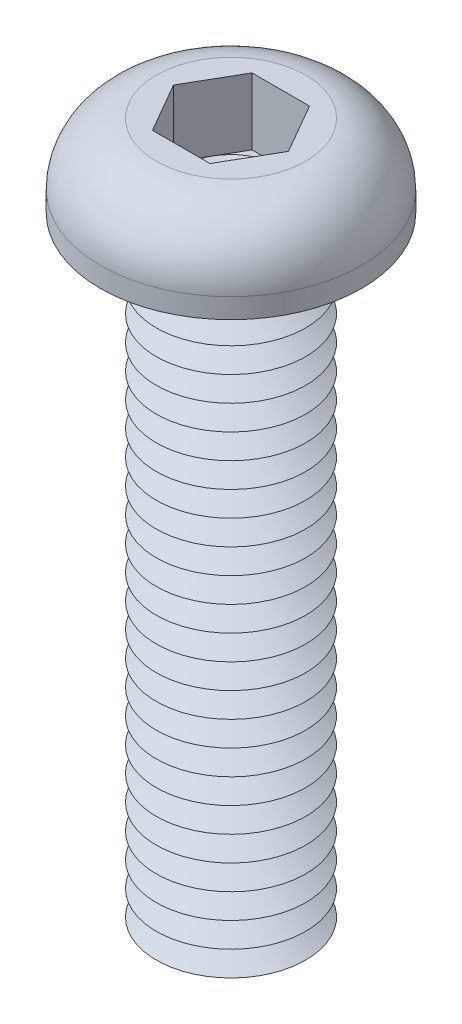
ISO-10303-21;
HEADER;
FILE_DESCRIPTION(('STEP AP214'),'2;1');
FILE_NAME('part.step','',(''),(''),'','','');
FILE_SCHEMA(('AUTOMOTIVE_DESIGN { 1 0 10303 214 1 1 1 1 }'));
ENDSEC;
DATA;
#1=APPLICATION_CONTEXT('core data for automotive mechanical design processes');
#2=APPLICATION_PROTOCOL_DEFINITION('international standard','automotive_design',2000,#1);
#3=PRODUCT_CONTEXT('',#1,'mechanical');
#4=PRODUCT('Part','Part','',(#3));
#5=PRODUCT_RELATED_PRODUCT_CATEGORY('part','',(#4));
#6=PRODUCT_DEFINITION_FORMATION('','',#4);
#7=PRODUCT_DEFINITION_CONTEXT('part definition',#1,'design');
#8=PRODUCT_DEFINITION('design','',#6,#7);
#9=PRODUCT_DEFINITION_SHAPE('','',#8);
#10=(LENGTH_UNIT() NAMED_UNIT(*) SI_UNIT(.MILLI.,.METRE.));
#11=(NAMED_UNIT(*) PLANE_ANGLE_UNIT() SI_UNIT($,.RADIAN.));
#12=(NAMED_UNIT(*) SI_UNIT($,.STERADIAN.) SOLID_ANGLE_UNIT());
#13=UNCERTAINTY_MEASURE_WITH_UNIT(LENGTH_MEASURE(1.E-05),#10,'distance_accuracy_value','');
#14=(GEOMETRIC_REPRESENTATION_CONTEXT(3) GLOBAL_UNCERTAINTY_ASSIGNED_CONTEXT((#13)) GLOBAL_UNIT_ASSIGNED_CONTEXT((#10,
#11,#12)) REPRESENTATION_CONTEXT('',''));
#15=CARTESIAN_POINT('',(0.,0.,0.));
#16=DIRECTION('',(0.,0.,1.));
#17=DIRECTION('',(1.,0.,0.));
#18=AXIS2_PLACEMENT_3D('',#15,#16,#17);
#19=CARTESIAN_POINT('',(0.,0.,0.));
#20=DIRECTION('',(0.,-1.,0.));
#21=DIRECTION('',(0.,0.,-1.));
#22=AXIS2_PLACEMENT_3D('',#19,#20,#21);
#23=TOROIDAL_SURFACE('',#22,3.5,0.5);
#24=CARTESIAN_POINT('',(0.,0.,-4.));
#25=VERTEX_POINT('',#24);
#26=VERTEX_LOOP('',#25);
#27=FACE_BOUND('',#26,.T.);
#28=ADVANCED_FACE('P0_F12',(#27),#23,.T.);
#29=CLOSED_SHELL('',(#28));
#30=MANIFOLD_SOLID_BREP('P0_B1',#29);
#31=CARTESIAN_POINT('',(1.15470053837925,0.62,-2.));
#32=DIRECTION('',(0.,1.,0.));
#33=DIRECTION('',(0.,0.,1.));
#34=AXIS2_PLACEMENT_3D('',#31,#32,#33);
#35=PLANE('',#34);
#36=CARTESIAN_POINT('',(0.,0.62,0.));
#37=DIRECTION('',(0.,1.,0.));
#38=DIRECTION('',(0.,0.,1.));
#39=AXIS2_PLACEMENT_3D('',#36,#37,#38);
#40=CIRCLE('',#39,2.);
#41=CARTESIAN_POINT('',(0.,0.62,2.));
#42=VERTEX_POINT('',#41);
#43=CARTESIAN_POINT('',(1.73205080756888,0.62,1.));
#44=VERTEX_POINT('',#43);
#45=EDGE_CURVE('P1_E93',#42,#44,#40,.T.);
#46=ORIENTED_EDGE('',*,*,#45,.F.);
#47=DIRECTION('',(1.,0.,0.));
#48=VECTOR('',#47,1.);
#49=CARTESIAN_POINT('',(-1.15470053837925,0.62,2.));
#50=LINE('',#49,#48);
#51=CARTESIAN_POINT('',(1.15470053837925,0.62,2.));
#52=VERTEX_POINT('',#51);
#53=EDGE_CURVE('P1_E116',#42,#52,#50,.T.);
#54=ORIENTED_EDGE('',*,*,#53,.T.);
#55=DIRECTION('',(0.5,0.,-0.866025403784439));
#56=VECTOR('',#55,1.);
#57=CARTESIAN_POINT('',(1.15470053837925,0.62,2.));
#58=LINE('',#57,#56);
#59=EDGE_CURVE('P1_E112',#52,#44,#58,.T.);
#60=ORIENTED_EDGE('',*,*,#59,.T.);
#61=EDGE_LOOP('',(#46,#54,#60));
#62=FACE_BOUND('',#61,.T.);
#63=ADVANCED_FACE('P1_F15',(#62),#35,.T.);
#64=CARTESIAN_POINT('',(0.,0.62,0.));
#65=DIRECTION('',(0.,1.,0.));
#66=DIRECTION('',(0.,0.,1.));
#67=AXIS2_PLACEMENT_3D('',#64,#65,#66);
#68=CIRCLE('',#67,2.);
#69=CARTESIAN_POINT('',(1.73205080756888,0.62,-1.));
#70=VERTEX_POINT('',#69);
#71=EDGE_CURVE('P1_E10',#44,#70,#68,.T.);
#72=ORIENTED_EDGE('',*,*,#71,.F.);
#73=CARTESIAN_POINT('',(2.3094010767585,0.62,0.));
#74=VERTEX_POINT('',#73);
#75=EDGE_CURVE('P1_E104',#44,#74,#58,.T.);
#76=ORIENTED_EDGE('',*,*,#75,.T.);
#77=DIRECTION('',(-0.5,0.,-0.866025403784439));
#78=VECTOR('',#77,1.);
#79=CARTESIAN_POINT('',(2.3094010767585,0.62,0.));
#80=LINE('',#79,#78);
#81=EDGE_CURVE('P1_E107',#74,#70,#80,.T.);
#82=ORIENTED_EDGE('',*,*,#81,.T.);
#83=EDGE_LOOP('',(#72,#76,#82));
#84=FACE_BOUND('',#83,.T.);
#85=ADVANCED_FACE('P1_F103',(#84),#35,.T.);
#86=CARTESIAN_POINT('',(0.,0.62,-2.));
#87=VERTEX_POINT('',#86);
#88=EDGE_CURVE('P1_E24',#70,#87,#68,.T.);
#89=ORIENTED_EDGE('',*,*,#88,.F.);
#90=CARTESIAN_POINT('',(1.15470053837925,0.62,-2.));
#91=VERTEX_POINT('',#90);
#92=EDGE_CURVE('P1_E139',#70,#91,#80,.T.);
#93=ORIENTED_EDGE('',*,*,#92,.T.);
#94=DIRECTION('',(-1.,0.,0.));
#95=VECTOR('',#94,1.);
#96=CARTESIAN_POINT('',(1.15470053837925,0.62,-2.));
#97=LINE('',#96,#95);
#98=EDGE_CURVE('P1_E366',#91,#87,#97,.T.);
#99=ORIENTED_EDGE('',*,*,#98,.T.);
#100=EDGE_LOOP('',(#89,#93,#99));
#101=FACE_BOUND('',#100,.T.);
#102=ADVANCED_FACE('P1_F331',(#101),#35,.T.);
#103=CARTESIAN_POINT('',(-1.73205080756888,0.62,-1.));
#104=VERTEX_POINT('',#103);
#105=EDGE_CURVE('P1_E361',#87,#104,#68,.T.);
#106=ORIENTED_EDGE('',*,*,#105,.F.);
#107=CARTESIAN_POINT('',(-1.15470053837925,0.62,-2.));
#108=VERTEX_POINT('',#107);
#109=EDGE_CURVE('P1_E370',#87,#108,#97,.T.);
#110=ORIENTED_EDGE('',*,*,#109,.T.);
#111=DIRECTION('',(-0.5,0.,0.866025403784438));
#112=VECTOR('',#111,1.);
#113=CARTESIAN_POINT('',(-1.15470053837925,0.62,-2.));
#114=LINE('',#113,#112);
#115=EDGE_CURVE('P1_E365',#108,#104,#114,.T.);
#116=ORIENTED_EDGE('',*,*,#115,.T.);
#117=EDGE_LOOP('',(#106,#110,#116));
#118=FACE_BOUND('',#117,.T.);
#119=ADVANCED_FACE('P1_F345',(#118),#35,.T.);
#120=CARTESIAN_POINT('',(-1.73205080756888,0.62,1.));
#121=VERTEX_POINT('',#120);
#122=EDGE_CURVE('P1_E31',#104,#121,#68,.T.);
#123=ORIENTED_EDGE('',*,*,#122,.F.);
#124=CARTESIAN_POINT('',(-2.3094010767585,0.62,0.));
#125=VERTEX_POINT('',#124);
#126=EDGE_CURVE('P1_E357',#104,#125,#114,.T.);
#127=ORIENTED_EDGE('',*,*,#126,.T.);
#128=DIRECTION('',(0.5,0.,0.866025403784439));
#129=VECTOR('',#128,1.);
#130=CARTESIAN_POINT('',(-2.3094010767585,0.62,0.));
#131=LINE('',#130,#129);
#132=EDGE_CURVE('P1_E360',#125,#121,#131,.T.);
#133=ORIENTED_EDGE('',*,*,#132,.T.);
#134=EDGE_LOOP('',(#123,#127,#133));
#135=FACE_BOUND('',#134,.T.);
#136=ADVANCED_FACE('P1_F336',(#135),#35,.T.);
#137=CARTESIAN_POINT('',(0.,-24.,0.));
#138=DIRECTION('',(0.,1.,0.));
#139=DIRECTION('',(0.,0.,1.));
#140=AXIS2_PLACEMENT_3D('',#137,#138,#139);
#141=CONICAL_SURFACE('',#140,2.13397459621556,1.0471975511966);
#142=CARTESIAN_POINT('',(0.,-23.5,0.));
#143=DIRECTION('',(0.,-1.,0.));
#144=DIRECTION('',(0.,0.,-1.));
#145=AXIS2_PLACEMENT_3D('',#142,#143,#144);
#146=CIRCLE('',#145,3.);
#147=CARTESIAN_POINT('',(0.,-23.5,-3.));
#148=VERTEX_POINT('',#147);
#149=EDGE_CURVE('P1_E293',#148,#148,#146,.T.);
#150=ORIENTED_EDGE('',*,*,#149,.T.);
#151=EDGE_LOOP('',(#150));
#152=FACE_BOUND('',#151,.T.);
#153=CARTESIAN_POINT('',(0.,-24.,0.));
#154=DIRECTION('',(0.,-1.,0.));
#155=DIRECTION('',(0.,0.,-1.));
#156=AXIS2_PLACEMENT_3D('',#153,#154,#155);
#157=CIRCLE('',#156,2.13397459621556);
#158=CARTESIAN_POINT('',(0.,-24.,-2.13397459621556));
#159=VERTEX_POINT('',#158);
#160=EDGE_CURVE('P1_E296',#159,#159,#157,.T.);
#161=ORIENTED_EDGE('',*,*,#160,.F.);
#162=EDGE_LOOP('',(#161));
#163=FACE_BOUND('',#162,.T.);
#164=ADVANCED_FACE('P1_F344',(#152,#163),#141,.T.);
#165=CARTESIAN_POINT('',(0.,-24.5,0.));
#166=DIRECTION('',(0.,-1.,0.));
#167=DIRECTION('',(0.,0.,-1.));
#168=AXIS2_PLACEMENT_3D('',#165,#166,#167);
#169=CONICAL_SURFACE('',#168,3.,1.0471975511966);
#170=ORIENTED_EDGE('',*,*,#160,.T.);
#171=EDGE_LOOP('',(#170));
#172=FACE_BOUND('',#171,.T.);
#173=CARTESIAN_POINT('',(0.,-24.5,0.));
#174=DIRECTION('',(0.,-1.,0.));
#175=DIRECTION('',(0.,0.,-1.));
#176=AXIS2_PLACEMENT_3D('',#173,#174,#175);
#177=CIRCLE('',#176,3.);
#178=CARTESIAN_POINT('',(0.,-24.5,-3.));
#179=VERTEX_POINT('',#178);
#180=EDGE_CURVE('P1_E299',#179,#179,#177,.T.);
#181=ORIENTED_EDGE('',*,*,#180,.F.);
#182=EDGE_LOOP('',(#181));
#183=FACE_BOUND('',#182,.T.);
#184=ADVANCED_FACE('P1_F351',(#172,#183),#169,.T.);
#185=CARTESIAN_POINT('',(0.,-25.,0.));
#186=DIRECTION('',(0.,1.,0.));
#187=DIRECTION('',(0.,0.,1.));
#188=AXIS2_PLACEMENT_3D('',#185,#186,#187);
#189=PLANE('',#188);
#190=CARTESIAN_POINT('',(0.,-25.,0.));
#191=DIRECTION('',(0.,-1.,0.));
#192=DIRECTION('',(0.,0.,-1.));
#193=AXIS2_PLACEMENT_3D('',#190,#191,#192);
#194=CIRCLE('',#193,2.13397459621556);
#195=CARTESIAN_POINT('',(0.,-25.,-2.13397459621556));
#196=VERTEX_POINT('',#195);
#197=EDGE_CURVE('P1_E302',#196,#196,#194,.T.);
#198=ORIENTED_EDGE('',*,*,#197,.T.);
#199=EDGE_LOOP('',(#198));
#200=FACE_BOUND('',#199,.T.);
#201=ADVANCED_FACE('P1_F429',(#200),#189,.F.);
#202=CARTESIAN_POINT('',(0.,-25.,0.));
#203=DIRECTION('',(0.,1.,0.));
#204=DIRECTION('',(0.,0.,1.));
#205=AXIS2_PLACEMENT_3D('',#202,#203,#204);
#206=CONICAL_SURFACE('',#205,2.13397459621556,1.0471975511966);
#207=ORIENTED_EDGE('',*,*,#180,.T.);
#208=EDGE_LOOP('',(#207));
#209=FACE_BOUND('',#208,.T.);
#210=ORIENTED_EDGE('',*,*,#197,.F.);
#211=EDGE_LOOP('',(#210));
#212=FACE_BOUND('',#211,.T.);
#213=ADVANCED_FACE('P1_F440',(#209,#212),#206,.T.);
#214=CARTESIAN_POINT('',(0.,-23.,0.));
#215=DIRECTION('',(0.,1.,0.));
#216=DIRECTION('',(0.,0.,1.));
#217=AXIS2_PLACEMENT_3D('',#214,#215,#216);
#218=CONICAL_SURFACE('',#217,2.13397459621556,1.0471975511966);
#219=CARTESIAN_POINT('',(0.,-22.5,0.));
#220=DIRECTION('',(0.,-1.,0.));
#221=DIRECTION('',(0.,0.,-1.));
#222=AXIS2_PLACEMENT_3D('',#219,#220,#221);
#223=CIRCLE('',#222,3.);
#224=CARTESIAN_POINT('',(0.,-22.5,-3.));
#225=VERTEX_POINT('',#224);
#226=EDGE_CURVE('P1_E287',#225,#225,#223,.T.);
#227=ORIENTED_EDGE('',*,*,#226,.T.);
#228=EDGE_LOOP('',(#227));
#229=FACE_BOUND('',#228,.T.);
#230=CARTESIAN_POINT('',(0.,-23.,0.));
#231=DIRECTION('',(0.,-1.,0.));
#232=DIRECTION('',(0.,0.,-1.));
#233=AXIS2_PLACEMENT_3D('',#230,#231,#232);
#234=CIRCLE('',#233,2.13397459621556);
#235=CARTESIAN_POINT('',(0.,-23.,-2.13397459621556));
#236=VERTEX_POINT('',#235);
#237=EDGE_CURVE('P1_E290',#236,#236,#234,.T.);
#238=ORIENTED_EDGE('',*,*,#237,.F.);
#239=EDGE_LOOP('',(#238));
#240=FACE_BOUND('',#239,.T.);
#241=ADVANCED_FACE('P1_F449',(#229,#240),#218,.T.);
#242=CARTESIAN_POINT('',(0.,-23.5,0.));
#243=DIRECTION('',(0.,-1.,0.));
#244=DIRECTION('',(0.,0.,-1.));
#245=AXIS2_PLACEMENT_3D('',#242,#243,#244);
#246=CONICAL_SURFACE('',#245,3.,1.0471975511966);
#247=ORIENTED_EDGE('',*,*,#237,.T.);
#248=EDGE_LOOP('',(#247));
#249=FACE_BOUND('',#248,.T.);
#250=ORIENTED_EDGE('',*,*,#149,.F.);
#251=EDGE_LOOP('',(#250));
#252=FACE_BOUND('',#251,.T.);
#253=ADVANCED_FACE('P1_F458',(#249,#252),#246,.T.);
#254=CARTESIAN_POINT('',(0.,-22.,0.));
#255=DIRECTION('',(0.,1.,0.));
#256=DIRECTION('',(0.,0.,1.));
#257=AXIS2_PLACEMENT_3D('',#254,#255,#256);
#258=CONICAL_SURFACE('',#257,2.13397459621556,1.0471975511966);
#259=CARTESIAN_POINT('',(0.,-21.5,0.));
#260=DIRECTION('',(0.,-1.,0.));
#261=DIRECTION('',(0.,0.,-1.));
#262=AXIS2_PLACEMENT_3D('',#259,#260,#261);
#263=CIRCLE('',#262,3.);
#264=CARTESIAN_POINT('',(0.,-21.5,-3.));
#265=VERTEX_POINT('',#264);
#266=EDGE_CURVE('P1_E281',#265,#265,#263,.T.);
#267=ORIENTED_EDGE('',*,*,#266,.T.);
#268=EDGE_LOOP('',(#267));
#269=FACE_BOUND('',#268,.T.);
#270=CARTESIAN_POINT('',(0.,-22.,0.));
#271=DIRECTION('',(0.,-1.,0.));
#272=DIRECTION('',(0.,0.,-1.));
#273=AXIS2_PLACEMENT_3D('',#270,#271,#272);
#274=CIRCLE('',#273,2.13397459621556);
#275=CARTESIAN_POINT('',(0.,-22.,-2.13397459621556));
#276=VERTEX_POINT('',#275);
#277=EDGE_CURVE('P1_E284',#276,#276,#274,.T.);
#278=ORIENTED_EDGE('',*,*,#277,.F.);
#279=EDGE_LOOP('',(#278));
#280=FACE_BOUND('',#279,.T.);
#281=ADVANCED_FACE('P1_F468',(#269,#280),#258,.T.);
#282=CARTESIAN_POINT('',(0.,-22.5,0.));
#283=DIRECTION('',(0.,-1.,0.));
#284=DIRECTION('',(0.,0.,-1.));
#285=AXIS2_PLACEMENT_3D('',#282,#283,#284);
#286=CONICAL_SURFACE('',#285,3.,1.0471975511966);
#287=ORIENTED_EDGE('',*,*,#277,.T.);
#288=EDGE_LOOP('',(#287));
#289=FACE_BOUND('',#288,.T.);
#290=ORIENTED_EDGE('',*,*,#226,.F.);
#291=EDGE_LOOP('',(#290));
#292=FACE_BOUND('',#291,.T.);
#293=ADVANCED_FACE('P1_F478',(#289,#292),#286,.T.);
#294=CARTESIAN_POINT('',(0.,-21.,0.));
#295=DIRECTION('',(0.,1.,0.));
#296=DIRECTION('',(0.,0.,1.));
#297=AXIS2_PLACEMENT_3D('',#294,#295,#296);
#298=CONICAL_SURFACE('',#297,2.13397459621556,1.0471975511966);
#299=CARTESIAN_POINT('',(0.,-20.5,0.));
#300=DIRECTION('',(0.,-1.,0.));
#301=DIRECTION('',(0.,0.,-1.));
#302=AXIS2_PLACEMENT_3D('',#299,#300,#301);
#303=CIRCLE('',#302,3.);
#304=CARTESIAN_POINT('',(0.,-20.5,-3.));
#305=VERTEX_POINT('',#304);
#306=EDGE_CURVE('P1_E275',#305,#305,#303,.T.);
#307=ORIENTED_EDGE('',*,*,#306,.T.);
#308=EDGE_LOOP('',(#307));
#309=FACE_BOUND('',#308,.T.);
#310=CARTESIAN_POINT('',(0.,-21.,0.));
#311=DIRECTION('',(0.,-1.,0.));
#312=DIRECTION('',(0.,0.,-1.));
#313=AXIS2_PLACEMENT_3D('',#310,#311,#312);
#314=CIRCLE('',#313,2.13397459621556);
#315=CARTESIAN_POINT('',(0.,-21.,-2.13397459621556));
#316=VERTEX_POINT('',#315);
#317=EDGE_CURVE('P1_E278',#316,#316,#314,.T.);
#318=ORIENTED_EDGE('',*,*,#317,.F.);
#319=EDGE_LOOP('',(#318));
#320=FACE_BOUND('',#319,.T.);
#321=ADVANCED_FACE('P1_F488',(#309,#320),#298,.T.);
#322=CARTESIAN_POINT('',(0.,-21.5,0.));
#323=DIRECTION('',(0.,-1.,0.));
#324=DIRECTION('',(0.,0.,-1.));
#325=AXIS2_PLACEMENT_3D('',#322,#323,#324);
#326=CONICAL_SURFACE('',#325,3.,1.0471975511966);
#327=ORIENTED_EDGE('',*,*,#317,.T.);
#328=EDGE_LOOP('',(#327));
#329=FACE_BOUND('',#328,.T.);
#330=ORIENTED_EDGE('',*,*,#266,.F.);
#331=EDGE_LOOP('',(#330));
#332=FACE_BOUND('',#331,.T.);
#333=ADVANCED_FACE('P1_F498',(#329,#332),#326,.T.);
#334=CARTESIAN_POINT('',(0.,-20.,0.));
#335=DIRECTION('',(0.,1.,0.));
#336=DIRECTION('',(0.,0.,1.));
#337=AXIS2_PLACEMENT_3D('',#334,#335,#336);
#338=CONICAL_SURFACE('',#337,2.13397459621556,1.0471975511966);
#339=CARTESIAN_POINT('',(0.,-19.5,0.));
#340=DIRECTION('',(0.,-1.,0.));
#341=DIRECTION('',(0.,0.,-1.));
#342=AXIS2_PLACEMENT_3D('',#339,#340,#341);
#343=CIRCLE('',#342,3.);
#344=CARTESIAN_POINT('',(0.,-19.5,-3.));
#345=VERTEX_POINT('',#344);
#346=EDGE_CURVE('P1_E269',#345,#345,#343,.T.);
#347=ORIENTED_EDGE('',*,*,#346,.T.);
#348=EDGE_LOOP('',(#347));
#349=FACE_BOUND('',#348,.T.);
#350=CARTESIAN_POINT('',(0.,-20.,0.));
#351=DIRECTION('',(0.,-1.,0.));
#352=DIRECTION('',(0.,0.,-1.));
#353=AXIS2_PLACEMENT_3D('',#350,#351,#352);
#354=CIRCLE('',#353,2.13397459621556);
#355=CARTESIAN_POINT('',(0.,-20.,-2.13397459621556));
#356=VERTEX_POINT('',#355);
#357=EDGE_CURVE('P1_E272',#356,#356,#354,.T.);
#358=ORIENTED_EDGE('',*,*,#357,.F.);
#359=EDGE_LOOP('',(#358));
#360=FACE_BOUND('',#359,.T.);
#361=ADVANCED_FACE('P1_F508',(#349,#360),#338,.T.);
#362=CARTESIAN_POINT('',(0.,-20.5,0.));
#363=DIRECTION('',(0.,-1.,0.));
#364=DIRECTION('',(0.,0.,-1.));
#365=AXIS2_PLACEMENT_3D('',#362,#363,#364);
#366=CONICAL_SURFACE('',#365,3.,1.0471975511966);
#367=ORIENTED_EDGE('',*,*,#357,.T.);
#368=EDGE_LOOP('',(#367));
#369=FACE_BOUND('',#368,.T.);
#370=ORIENTED_EDGE('',*,*,#306,.F.);
#371=EDGE_LOOP('',(#370));
#372=FACE_BOUND('',#371,.T.);
#373=ADVANCED_FACE('P1_F518',(#369,#372),#366,.T.);
#374=CARTESIAN_POINT('',(0.,-19.,0.));
#375=DIRECTION('',(0.,1.,0.));
#376=DIRECTION('',(0.,0.,1.));
#377=AXIS2_PLACEMENT_3D('',#374,#375,#376);
#378=CONICAL_SURFACE('',#377,2.13397459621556,1.0471975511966);
#379=CARTESIAN_POINT('',(0.,-18.5,0.));
#380=DIRECTION('',(0.,-1.,0.));
#381=DIRECTION('',(0.,0.,-1.));
#382=AXIS2_PLACEMENT_3D('',#379,#380,#381);
#383=CIRCLE('',#382,3.);
#384=CARTESIAN_POINT('',(0.,-18.5,-3.));
#385=VERTEX_POINT('',#384);
#386=EDGE_CURVE('P1_E263',#385,#385,#383,.T.);
#387=ORIENTED_EDGE('',*,*,#386,.T.);
#388=EDGE_LOOP('',(#387));
#389=FACE_BOUND('',#388,.T.);
#390=CARTESIAN_POINT('',(0.,-19.,0.));
#391=DIRECTION('',(0.,-1.,0.));
#392=DIRECTION('',(0.,0.,-1.));
#393=AXIS2_PLACEMENT_3D('',#390,#391,#392);
#394=CIRCLE('',#393,2.13397459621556);
#395=CARTESIAN_POINT('',(0.,-19.,-2.13397459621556));
#396=VERTEX_POINT('',#395);
#397=EDGE_CURVE('P1_E266',#396,#396,#394,.T.);
#398=ORIENTED_EDGE('',*,*,#397,.F.);
#399=EDGE_LOOP('',(#398));
#400=FACE_BOUND('',#399,.T.);
#401=ADVANCED_FACE('P1_F528',(#389,#400),#378,.T.);
#402=CARTESIAN_POINT('',(0.,-19.5,0.));
#403=DIRECTION('',(0.,-1.,0.));
#404=DIRECTION('',(0.,0.,-1.));
#405=AXIS2_PLACEMENT_3D('',#402,#403,#404);
#406=CONICAL_SURFACE('',#405,3.,1.0471975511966);
#407=ORIENTED_EDGE('',*,*,#397,.T.);
#408=EDGE_LOOP('',(#407));
#409=FACE_BOUND('',#408,.T.);
#410=ORIENTED_EDGE('',*,*,#346,.F.);
#411=EDGE_LOOP('',(#410));
#412=FACE_BOUND('',#411,.T.);
#413=ADVANCED_FACE('P1_F538',(#409,#412),#406,.T.);
#414=CARTESIAN_POINT('',(0.,-18.,0.));
#415=DIRECTION('',(0.,1.,0.));
#416=DIRECTION('',(0.,0.,1.));
#417=AXIS2_PLACEMENT_3D('',#414,#415,#416);
#418=CONICAL_SURFACE('',#417,2.13397459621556,1.0471975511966);
#419=CARTESIAN_POINT('',(0.,-17.5,0.));
#420=DIRECTION('',(0.,-1.,0.));
#421=DIRECTION('',(0.,0.,-1.));
#422=AXIS2_PLACEMENT_3D('',#419,#420,#421);
#423=CIRCLE('',#422,3.);
#424=CARTESIAN_POINT('',(0.,-17.5,-3.));
#425=VERTEX_POINT('',#424);
#426=EDGE_CURVE('P1_E257',#425,#425,#423,.T.);
#427=ORIENTED_EDGE('',*,*,#426,.T.);
#428=EDGE_LOOP('',(#427));
#429=FACE_BOUND('',#428,.T.);
#430=CARTESIAN_POINT('',(0.,-18.,0.));
#431=DIRECTION('',(0.,-1.,0.));
#432=DIRECTION('',(0.,0.,-1.));
#433=AXIS2_PLACEMENT_3D('',#430,#431,#432);
#434=CIRCLE('',#433,2.13397459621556);
#435=CARTESIAN_POINT('',(0.,-18.,-2.13397459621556));
#436=VERTEX_POINT('',#435);
#437=EDGE_CURVE('P1_E260',#436,#436,#434,.T.);
#438=ORIENTED_EDGE('',*,*,#437,.F.);
#439=EDGE_LOOP('',(#438));
#440=FACE_BOUND('',#439,.T.);
#441=ADVANCED_FACE('P1_F548',(#429,#440),#418,.T.);
#442=CARTESIAN_POINT('',(0.,-18.5,0.));
#443=DIRECTION('',(0.,-1.,0.));
#444=DIRECTION('',(0.,0.,-1.));
#445=AXIS2_PLACEMENT_3D('',#442,#443,#444);
#446=CONICAL_SURFACE('',#445,3.,1.0471975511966);
#447=ORIENTED_EDGE('',*,*,#437,.T.);
#448=EDGE_LOOP('',(#447));
#449=FACE_BOUND('',#448,.T.);
#450=ORIENTED_EDGE('',*,*,#386,.F.);
#451=EDGE_LOOP('',(#450));
#452=FACE_BOUND('',#451,.T.);
#453=ADVANCED_FACE('P1_F558',(#449,#452),#446,.T.);
#454=CARTESIAN_POINT('',(0.,-17.,0.));
#455=DIRECTION('',(0.,1.,0.));
#456=DIRECTION('',(0.,0.,1.));
#457=AXIS2_PLACEMENT_3D('',#454,#455,#456);
#458=CONICAL_SURFACE('',#457,2.13397459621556,1.0471975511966);
#459=CARTESIAN_POINT('',(0.,-16.5,0.));
#460=DIRECTION('',(0.,-1.,0.));
#461=DIRECTION('',(0.,0.,-1.));
#462=AXIS2_PLACEMENT_3D('',#459,#460,#461);
#463=CIRCLE('',#462,3.);
#464=CARTESIAN_POINT('',(0.,-16.5,-3.));
#465=VERTEX_POINT('',#464);
#466=EDGE_CURVE('P1_E251',#465,#465,#463,.T.);
#467=ORIENTED_EDGE('',*,*,#466,.T.);
#468=EDGE_LOOP('',(#467));
#469=FACE_BOUND('',#468,.T.);
#470=CARTESIAN_POINT('',(0.,-17.,0.));
#471=DIRECTION('',(0.,-1.,0.));
#472=DIRECTION('',(0.,0.,-1.));
#473=AXIS2_PLACEMENT_3D('',#470,#471,#472);
#474=CIRCLE('',#473,2.13397459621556);
#475=CARTESIAN_POINT('',(0.,-17.,-2.13397459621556));
#476=VERTEX_POINT('',#475);
#477=EDGE_CURVE('P1_E254',#476,#476,#474,.T.);
#478=ORIENTED_EDGE('',*,*,#477,.F.);
#479=EDGE_LOOP('',(#478));
#480=FACE_BOUND('',#479,.T.);
#481=ADVANCED_FACE('P1_F568',(#469,#480),#458,.T.);
#482=CARTESIAN_POINT('',(0.,-17.5,0.));
#483=DIRECTION('',(0.,-1.,0.));
#484=DIRECTION('',(0.,0.,-1.));
#485=AXIS2_PLACEMENT_3D('',#482,#483,#484);
#486=CONICAL_SURFACE('',#485,3.,1.0471975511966);
#487=ORIENTED_EDGE('',*,*,#477,.T.);
#488=EDGE_LOOP('',(#487));
#489=FACE_BOUND('',#488,.T.);
#490=ORIENTED_EDGE('',*,*,#426,.F.);
#491=EDGE_LOOP('',(#490));
#492=FACE_BOUND('',#491,.T.);
#493=ADVANCED_FACE('P1_F578',(#489,#492),#486,.T.);
#494=CARTESIAN_POINT('',(0.,-16.,0.));
#495=DIRECTION('',(0.,1.,0.));
#496=DIRECTION('',(0.,0.,1.));
#497=AXIS2_PLACEMENT_3D('',#494,#495,#496);
#498=CONICAL_SURFACE('',#497,2.13397459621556,1.0471975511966);
#499=CARTESIAN_POINT('',(0.,-15.5,0.));
#500=DIRECTION('',(0.,-1.,0.));
#501=DIRECTION('',(0.,0.,-1.));
#502=AXIS2_PLACEMENT_3D('',#499,#500,#501);
#503=CIRCLE('',#502,3.);
#504=CARTESIAN_POINT('',(0.,-15.5,-3.));
#505=VERTEX_POINT('',#504);
#506=EDGE_CURVE('P1_E245',#505,#505,#503,.T.);
#507=ORIENTED_EDGE('',*,*,#506,.T.);
#508=EDGE_LOOP('',(#507));
#509=FACE_BOUND('',#508,.T.);
#510=CARTESIAN_POINT('',(0.,-16.,0.));
#511=DIRECTION('',(0.,-1.,0.));
#512=DIRECTION('',(0.,0.,-1.));
#513=AXIS2_PLACEMENT_3D('',#510,#511,#512);
#514=CIRCLE('',#513,2.13397459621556);
#515=CARTESIAN_POINT('',(0.,-16.,-2.13397459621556));
#516=VERTEX_POINT('',#515);
#517=EDGE_CURVE('P1_E248',#516,#516,#514,.T.);
#518=ORIENTED_EDGE('',*,*,#517,.F.);
#519=EDGE_LOOP('',(#518));
#520=FACE_BOUND('',#519,.T.);
#521=ADVANCED_FACE('P1_F588',(#509,#520),#498,.T.);
#522=CARTESIAN_POINT('',(0.,-16.5,0.));
#523=DIRECTION('',(0.,-1.,0.));
#524=DIRECTION('',(0.,0.,-1.));
#525=AXIS2_PLACEMENT_3D('',#522,#523,#524);
#526=CONICAL_SURFACE('',#525,3.,1.0471975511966);
#527=ORIENTED_EDGE('',*,*,#517,.T.);
#528=EDGE_LOOP('',(#527));
#529=FACE_BOUND('',#528,.T.);
#530=ORIENTED_EDGE('',*,*,#466,.F.);
#531=EDGE_LOOP('',(#530));
#532=FACE_BOUND('',#531,.T.);
#533=ADVANCED_FACE('P1_F598',(#529,#532),#526,.T.);
#534=CARTESIAN_POINT('',(0.,-15.,0.));
#535=DIRECTION('',(0.,1.,0.));
#536=DIRECTION('',(0.,0.,1.));
#537=AXIS2_PLACEMENT_3D('',#534,#535,#536);
#538=CONICAL_SURFACE('',#537,2.13397459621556,1.0471975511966);
#539=CARTESIAN_POINT('',(0.,-14.5,0.));
#540=DIRECTION('',(0.,-1.,0.));
#541=DIRECTION('',(0.,0.,-1.));
#542=AXIS2_PLACEMENT_3D('',#539,#540,#541);
#543=CIRCLE('',#542,3.);
#544=CARTESIAN_POINT('',(0.,-14.5,-3.));
#545=VERTEX_POINT('',#544);
#546=EDGE_CURVE('P1_E239',#545,#545,#543,.T.);
#547=ORIENTED_EDGE('',*,*,#546,.T.);
#548=EDGE_LOOP('',(#547));
#549=FACE_BOUND('',#548,.T.);
#550=CARTESIAN_POINT('',(0.,-15.,0.));
#551=DIRECTION('',(0.,-1.,0.));
#552=DIRECTION('',(0.,0.,-1.));
#553=AXIS2_PLACEMENT_3D('',#550,#551,#552);
#554=CIRCLE('',#553,2.13397459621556);
#555=CARTESIAN_POINT('',(0.,-15.,-2.13397459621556));
#556=VERTEX_POINT('',#555);
#557=EDGE_CURVE('P1_E242',#556,#556,#554,.T.);
#558=ORIENTED_EDGE('',*,*,#557,.F.);
#559=EDGE_LOOP('',(#558));
#560=FACE_BOUND('',#559,.T.);
#561=ADVANCED_FACE('P1_F608',(#549,#560),#538,.T.);
#562=CARTESIAN_POINT('',(0.,-15.5,0.));
#563=DIRECTION('',(0.,-1.,0.));
#564=DIRECTION('',(0.,0.,-1.));
#565=AXIS2_PLACEMENT_3D('',#562,#563,#564);
#566=CONICAL_SURFACE('',#565,3.,1.0471975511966);
#567=ORIENTED_EDGE('',*,*,#557,.T.);
#568=EDGE_LOOP('',(#567));
#569=FACE_BOUND('',#568,.T.);
#570=ORIENTED_EDGE('',*,*,#506,.F.);
#571=EDGE_LOOP('',(#570));
#572=FACE_BOUND('',#571,.T.);
#573=ADVANCED_FACE('P1_F618',(#569,#572),#566,.T.);
#574=CARTESIAN_POINT('',(0.,-14.,0.));
#575=DIRECTION('',(0.,1.,0.));
#576=DIRECTION('',(0.,0.,1.));
#577=AXIS2_PLACEMENT_3D('',#574,#575,#576);
#578=CONICAL_SURFACE('',#577,2.13397459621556,1.0471975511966);
#579=CARTESIAN_POINT('',(0.,-13.5,0.));
#580=DIRECTION('',(0.,-1.,0.));
#581=DIRECTION('',(0.,0.,-1.));
#582=AXIS2_PLACEMENT_3D('',#579,#580,#581);
#583=CIRCLE('',#582,3.);
#584=CARTESIAN_POINT('',(0.,-13.5,-3.));
#585=VERTEX_POINT('',#584);
#586=EDGE_CURVE('P1_E233',#585,#585,#583,.T.);
#587=ORIENTED_EDGE('',*,*,#586,.T.);
#588=EDGE_LOOP('',(#587));
#589=FACE_BOUND('',#588,.T.);
#590=CARTESIAN_POINT('',(0.,-14.,0.));
#591=DIRECTION('',(0.,-1.,0.));
#592=DIRECTION('',(0.,0.,-1.));
#593=AXIS2_PLACEMENT_3D('',#590,#591,#592);
#594=CIRCLE('',#593,2.13397459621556);
#595=CARTESIAN_POINT('',(0.,-14.,-2.13397459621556));
#596=VERTEX_POINT('',#595);
#597=EDGE_CURVE('P1_E236',#596,#596,#594,.T.);
#598=ORIENTED_EDGE('',*,*,#597,.F.);
#599=EDGE_LOOP('',(#598));
#600=FACE_BOUND('',#599,.T.);
#601=ADVANCED_FACE('P1_F628',(#589,#600),#578,.T.);
#602=CARTESIAN_POINT('',(0.,-14.5,0.));
#603=DIRECTION('',(0.,-1.,0.));
#604=DIRECTION('',(0.,0.,-1.));
#605=AXIS2_PLACEMENT_3D('',#602,#603,#604);
#606=CONICAL_SURFACE('',#605,3.,1.0471975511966);
#607=ORIENTED_EDGE('',*,*,#597,.T.);
#608=EDGE_LOOP('',(#607));
#609=FACE_BOUND('',#608,.T.);
#610=ORIENTED_EDGE('',*,*,#546,.F.);
#611=EDGE_LOOP('',(#610));
#612=FACE_BOUND('',#611,.T.);
#613=ADVANCED_FACE('P1_F638',(#609,#612),#606,.T.);
#614=CARTESIAN_POINT('',(0.,-13.,0.));
#615=DIRECTION('',(0.,1.,0.));
#616=DIRECTION('',(0.,0.,1.));
#617=AXIS2_PLACEMENT_3D('',#614,#615,#616);
#618=CONICAL_SURFACE('',#617,2.13397459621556,1.0471975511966);
#619=CARTESIAN_POINT('',(0.,-12.5,0.));
#620=DIRECTION('',(0.,-1.,0.));
#621=DIRECTION('',(0.,0.,-1.));
#622=AXIS2_PLACEMENT_3D('',#619,#620,#621);
#623=CIRCLE('',#622,3.);
#624=CARTESIAN_POINT('',(0.,-12.5,-3.));
#625=VERTEX_POINT('',#624);
#626=EDGE_CURVE('P1_E227',#625,#625,#623,.T.);
#627=ORIENTED_EDGE('',*,*,#626,.T.);
#628=EDGE_LOOP('',(#627));
#629=FACE_BOUND('',#628,.T.);
#630=CARTESIAN_POINT('',(0.,-13.,0.));
#631=DIRECTION('',(0.,-1.,0.));
#632=DIRECTION('',(0.,0.,-1.));
#633=AXIS2_PLACEMENT_3D('',#630,#631,#632);
#634=CIRCLE('',#633,2.13397459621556);
#635=CARTESIAN_POINT('',(0.,-13.,-2.13397459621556));
#636=VERTEX_POINT('',#635);
#637=EDGE_CURVE('P1_E230',#636,#636,#634,.T.);
#638=ORIENTED_EDGE('',*,*,#637,.F.);
#639=EDGE_LOOP('',(#638));
#640=FACE_BOUND('',#639,.T.);
#641=ADVANCED_FACE('P1_F648',(#629,#640),#618,.T.);
#642=CARTESIAN_POINT('',(0.,-13.5,0.));
#643=DIRECTION('',(0.,-1.,0.));
#644=DIRECTION('',(0.,0.,-1.));
#645=AXIS2_PLACEMENT_3D('',#642,#643,#644);
#646=CONICAL_SURFACE('',#645,3.,1.0471975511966);
#647=ORIENTED_EDGE('',*,*,#637,.T.);
#648=EDGE_LOOP('',(#647));
#649=FACE_BOUND('',#648,.T.);
#650=ORIENTED_EDGE('',*,*,#586,.F.);
#651=EDGE_LOOP('',(#650));
#652=FACE_BOUND('',#651,.T.);
#653=ADVANCED_FACE('P1_F658',(#649,#652),#646,.T.);
#654=CARTESIAN_POINT('',(0.,-12.,0.));
#655=DIRECTION('',(0.,1.,0.));
#656=DIRECTION('',(0.,0.,1.));
#657=AXIS2_PLACEMENT_3D('',#654,#655,#656);
#658=CONICAL_SURFACE('',#657,2.13397459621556,1.0471975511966);
#659=CARTESIAN_POINT('',(0.,-11.5,0.));
#660=DIRECTION('',(0.,-1.,0.));
#661=DIRECTION('',(0.,0.,-1.));
#662=AXIS2_PLACEMENT_3D('',#659,#660,#661);
#663=CIRCLE('',#662,3.);
#664=CARTESIAN_POINT('',(0.,-11.5,-3.));
#665=VERTEX_POINT('',#664);
#666=EDGE_CURVE('P1_E221',#665,#665,#663,.T.);
#667=ORIENTED_EDGE('',*,*,#666,.T.);
#668=EDGE_LOOP('',(#667));
#669=FACE_BOUND('',#668,.T.);
#670=CARTESIAN_POINT('',(0.,-12.,0.));
#671=DIRECTION('',(0.,-1.,0.));
#672=DIRECTION('',(0.,0.,-1.));
#673=AXIS2_PLACEMENT_3D('',#670,#671,#672);
#674=CIRCLE('',#673,2.13397459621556);
#675=CARTESIAN_POINT('',(0.,-12.,-2.13397459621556));
#676=VERTEX_POINT('',#675);
#677=EDGE_CURVE('P1_E224',#676,#676,#674,.T.);
#678=ORIENTED_EDGE('',*,*,#677,.F.);
#679=EDGE_LOOP('',(#678));
#680=FACE_BOUND('',#679,.T.);
#681=ADVANCED_FACE('P1_F668',(#669,#680),#658,.T.);
#682=CARTESIAN_POINT('',(0.,-12.5,0.));
#683=DIRECTION('',(0.,-1.,0.));
#684=DIRECTION('',(0.,0.,-1.));
#685=AXIS2_PLACEMENT_3D('',#682,#683,#684);
#686=CONICAL_SURFACE('',#685,3.,1.0471975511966);
#687=ORIENTED_EDGE('',*,*,#677,.T.);
#688=EDGE_LOOP('',(#687));
#689=FACE_BOUND('',#688,.T.);
#690=ORIENTED_EDGE('',*,*,#626,.F.);
#691=EDGE_LOOP('',(#690));
#692=FACE_BOUND('',#691,.T.);
#693=ADVANCED_FACE('P1_F678',(#689,#692),#686,.T.);
#694=CARTESIAN_POINT('',(0.,-11.,0.));
#695=DIRECTION('',(0.,1.,0.));
#696=DIRECTION('',(0.,0.,1.));
#697=AXIS2_PLACEMENT_3D('',#694,#695,#696);
#698=CONICAL_SURFACE('',#697,2.13397459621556,1.0471975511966);
#699=CARTESIAN_POINT('',(0.,-10.5,0.));
#700=DIRECTION('',(0.,-1.,0.));
#701=DIRECTION('',(0.,0.,-1.));
#702=AXIS2_PLACEMENT_3D('',#699,#700,#701);
#703=CIRCLE('',#702,3.);
#704=CARTESIAN_POINT('',(0.,-10.5,-3.));
#705=VERTEX_POINT('',#704);
#706=EDGE_CURVE('P1_E215',#705,#705,#703,.T.);
#707=ORIENTED_EDGE('',*,*,#706,.T.);
#708=EDGE_LOOP('',(#707));
#709=FACE_BOUND('',#708,.T.);
#710=CARTESIAN_POINT('',(0.,-11.,0.));
#711=DIRECTION('',(0.,-1.,0.));
#712=DIRECTION('',(0.,0.,-1.));
#713=AXIS2_PLACEMENT_3D('',#710,#711,#712);
#714=CIRCLE('',#713,2.13397459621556);
#715=CARTESIAN_POINT('',(0.,-11.,-2.13397459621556));
#716=VERTEX_POINT('',#715);
#717=EDGE_CURVE('P1_E218',#716,#716,#714,.T.);
#718=ORIENTED_EDGE('',*,*,#717,.F.);
#719=EDGE_LOOP('',(#718));
#720=FACE_BOUND('',#719,.T.);
#721=ADVANCED_FACE('P1_F688',(#709,#720),#698,.T.);
#722=CARTESIAN_POINT('',(0.,-11.5,0.));
#723=DIRECTION('',(0.,-1.,0.));
#724=DIRECTION('',(0.,0.,-1.));
#725=AXIS2_PLACEMENT_3D('',#722,#723,#724);
#726=CONICAL_SURFACE('',#725,3.,1.0471975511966);
#727=ORIENTED_EDGE('',*,*,#717,.T.);
#728=EDGE_LOOP('',(#727));
#729=FACE_BOUND('',#728,.T.);
#730=ORIENTED_EDGE('',*,*,#666,.F.);
#731=EDGE_LOOP('',(#730));
#732=FACE_BOUND('',#731,.T.);
#733=ADVANCED_FACE('P1_F698',(#729,#732),#726,.T.);
#734=CARTESIAN_POINT('',(0.,-10.,0.));
#735=DIRECTION('',(0.,1.,0.));
#736=DIRECTION('',(0.,0.,1.));
#737=AXIS2_PLACEMENT_3D('',#734,#735,#736);
#738=CONICAL_SURFACE('',#737,2.13397459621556,1.0471975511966);
#739=CARTESIAN_POINT('',(0.,-9.5,0.));
#740=DIRECTION('',(0.,-1.,0.));
#741=DIRECTION('',(0.,0.,-1.));
#742=AXIS2_PLACEMENT_3D('',#739,#740,#741);
#743=CIRCLE('',#742,3.);
#744=CARTESIAN_POINT('',(0.,-9.5,-3.));
#745=VERTEX_POINT('',#744);
#746=EDGE_CURVE('P1_E209',#745,#745,#743,.T.);
#747=ORIENTED_EDGE('',*,*,#746,.T.);
#748=EDGE_LOOP('',(#747));
#749=FACE_BOUND('',#748,.T.);
#750=CARTESIAN_POINT('',(0.,-10.,0.));
#751=DIRECTION('',(0.,-1.,0.));
#752=DIRECTION('',(0.,0.,-1.));
#753=AXIS2_PLACEMENT_3D('',#750,#751,#752);
#754=CIRCLE('',#753,2.13397459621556);
#755=CARTESIAN_POINT('',(0.,-10.,-2.13397459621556));
#756=VERTEX_POINT('',#755);
#757=EDGE_CURVE('P1_E212',#756,#756,#754,.T.);
#758=ORIENTED_EDGE('',*,*,#757,.F.);
#759=EDGE_LOOP('',(#758));
#760=FACE_BOUND('',#759,.T.);
#761=ADVANCED_FACE('P1_F708',(#749,#760),#738,.T.);
#762=CARTESIAN_POINT('',(0.,-10.5,0.));
#763=DIRECTION('',(0.,-1.,0.));
#764=DIRECTION('',(0.,0.,-1.));
#765=AXIS2_PLACEMENT_3D('',#762,#763,#764);
#766=CONICAL_SURFACE('',#765,3.,1.0471975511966);
#767=ORIENTED_EDGE('',*,*,#757,.T.);
#768=EDGE_LOOP('',(#767));
#769=FACE_BOUND('',#768,.T.);
#770=ORIENTED_EDGE('',*,*,#706,.F.);
#771=EDGE_LOOP('',(#770));
#772=FACE_BOUND('',#771,.T.);
#773=ADVANCED_FACE('P1_F718',(#769,#772),#766,.T.);
#774=CARTESIAN_POINT('',(0.,-9.,0.));
#775=DIRECTION('',(0.,1.,0.));
#776=DIRECTION('',(0.,0.,1.));
#777=AXIS2_PLACEMENT_3D('',#774,#775,#776);
#778=CONICAL_SURFACE('',#777,2.13397459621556,1.0471975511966);
#779=CARTESIAN_POINT('',(0.,-8.5,0.));
#780=DIRECTION('',(0.,-1.,0.));
#781=DIRECTION('',(0.,0.,-1.));
#782=AXIS2_PLACEMENT_3D('',#779,#780,#781);
#783=CIRCLE('',#782,3.);
#784=CARTESIAN_POINT('',(0.,-8.5,-3.));
#785=VERTEX_POINT('',#784);
#786=EDGE_CURVE('P1_E203',#785,#785,#783,.T.);
#787=ORIENTED_EDGE('',*,*,#786,.T.);
#788=EDGE_LOOP('',(#787));
#789=FACE_BOUND('',#788,.T.);
#790=CARTESIAN_POINT('',(0.,-9.,0.));
#791=DIRECTION('',(0.,-1.,0.));
#792=DIRECTION('',(0.,0.,-1.));
#793=AXIS2_PLACEMENT_3D('',#790,#791,#792);
#794=CIRCLE('',#793,2.13397459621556);
#795=CARTESIAN_POINT('',(0.,-9.,-2.13397459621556));
#796=VERTEX_POINT('',#795);
#797=EDGE_CURVE('P1_E206',#796,#796,#794,.T.);
#798=ORIENTED_EDGE('',*,*,#797,.F.);
#799=EDGE_LOOP('',(#798));
#800=FACE_BOUND('',#799,.T.);
#801=ADVANCED_FACE('P1_F728',(#789,#800),#778,.T.);
#802=CARTESIAN_POINT('',(0.,-9.5,0.));
#803=DIRECTION('',(0.,-1.,0.));
#804=DIRECTION('',(0.,0.,-1.));
#805=AXIS2_PLACEMENT_3D('',#802,#803,#804);
#806=CONICAL_SURFACE('',#805,3.,1.0471975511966);
#807=ORIENTED_EDGE('',*,*,#797,.T.);
#808=EDGE_LOOP('',(#807));
#809=FACE_BOUND('',#808,.T.);
#810=ORIENTED_EDGE('',*,*,#746,.F.);
#811=EDGE_LOOP('',(#810));
#812=FACE_BOUND('',#811,.T.);
#813=ADVANCED_FACE('P1_F738',(#809,#812),#806,.T.);
#814=CARTESIAN_POINT('',(0.,-8.,0.));
#815=DIRECTION('',(0.,1.,0.));
#816=DIRECTION('',(0.,0.,1.));
#817=AXIS2_PLACEMENT_3D('',#814,#815,#816);
#818=CONICAL_SURFACE('',#817,2.13397459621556,1.0471975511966);
#819=CARTESIAN_POINT('',(0.,-7.5,0.));
#820=DIRECTION('',(0.,-1.,0.));
#821=DIRECTION('',(0.,0.,-1.));
#822=AXIS2_PLACEMENT_3D('',#819,#820,#821);
#823=CIRCLE('',#822,3.);
#824=CARTESIAN_POINT('',(0.,-7.5,-3.));
#825=VERTEX_POINT('',#824);
#826=EDGE_CURVE('P1_E197',#825,#825,#823,.T.);
#827=ORIENTED_EDGE('',*,*,#826,.T.);
#828=EDGE_LOOP('',(#827));
#829=FACE_BOUND('',#828,.T.);
#830=CARTESIAN_POINT('',(0.,-8.,0.));
#831=DIRECTION('',(0.,-1.,0.));
#832=DIRECTION('',(0.,0.,-1.));
#833=AXIS2_PLACEMENT_3D('',#830,#831,#832);
#834=CIRCLE('',#833,2.13397459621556);
#835=CARTESIAN_POINT('',(0.,-8.,-2.13397459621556));
#836=VERTEX_POINT('',#835);
#837=EDGE_CURVE('P1_E200',#836,#836,#834,.T.);
#838=ORIENTED_EDGE('',*,*,#837,.F.);
#839=EDGE_LOOP('',(#838));
#840=FACE_BOUND('',#839,.T.);
#841=ADVANCED_FACE('P1_F748',(#829,#840),#818,.T.);
#842=CARTESIAN_POINT('',(0.,-8.5,0.));
#843=DIRECTION('',(0.,-1.,0.));
#844=DIRECTION('',(0.,0.,-1.));
#845=AXIS2_PLACEMENT_3D('',#842,#843,#844);
#846=CONICAL_SURFACE('',#845,3.,1.0471975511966);
#847=ORIENTED_EDGE('',*,*,#837,.T.);
#848=EDGE_LOOP('',(#847));
#849=FACE_BOUND('',#848,.T.);
#850=ORIENTED_EDGE('',*,*,#786,.F.);
#851=EDGE_LOOP('',(#850));
#852=FACE_BOUND('',#851,.T.);
#853=ADVANCED_FACE('P1_F758',(#849,#852),#846,.T.);
#854=CARTESIAN_POINT('',(0.,-7.,0.));
#855=DIRECTION('',(0.,1.,0.));
#856=DIRECTION('',(0.,0.,1.));
#857=AXIS2_PLACEMENT_3D('',#854,#855,#856);
#858=CONICAL_SURFACE('',#857,2.13397459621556,1.0471975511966);
#859=CARTESIAN_POINT('',(0.,-6.5,0.));
#860=DIRECTION('',(0.,-1.,0.));
#861=DIRECTION('',(0.,0.,-1.));
#862=AXIS2_PLACEMENT_3D('',#859,#860,#861);
#863=CIRCLE('',#862,3.);
#864=CARTESIAN_POINT('',(0.,-6.5,-3.));
#865=VERTEX_POINT('',#864);
#866=EDGE_CURVE('P1_E191',#865,#865,#863,.T.);
#867=ORIENTED_EDGE('',*,*,#866,.T.);
#868=EDGE_LOOP('',(#867));
#869=FACE_BOUND('',#868,.T.);
#870=CARTESIAN_POINT('',(0.,-7.,0.));
#871=DIRECTION('',(0.,-1.,0.));
#872=DIRECTION('',(0.,0.,-1.));
#873=AXIS2_PLACEMENT_3D('',#870,#871,#872);
#874=CIRCLE('',#873,2.13397459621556);
#875=CARTESIAN_POINT('',(0.,-7.,-2.13397459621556));
#876=VERTEX_POINT('',#875);
#877=EDGE_CURVE('P1_E194',#876,#876,#874,.T.);
#878=ORIENTED_EDGE('',*,*,#877,.F.);
#879=EDGE_LOOP('',(#878));
#880=FACE_BOUND('',#879,.T.);
#881=ADVANCED_FACE('P1_F768',(#869,#880),#858,.T.);
#882=CARTESIAN_POINT('',(0.,-7.5,0.));
#883=DIRECTION('',(0.,-1.,0.));
#884=DIRECTION('',(0.,0.,-1.));
#885=AXIS2_PLACEMENT_3D('',#882,#883,#884);
#886=CONICAL_SURFACE('',#885,3.,1.0471975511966);
#887=ORIENTED_EDGE('',*,*,#877,.T.);
#888=EDGE_LOOP('',(#887));
#889=FACE_BOUND('',#888,.T.);
#890=ORIENTED_EDGE('',*,*,#826,.F.);
#891=EDGE_LOOP('',(#890));
#892=FACE_BOUND('',#891,.T.);
#893=ADVANCED_FACE('P1_F778',(#889,#892),#886,.T.);
#894=CARTESIAN_POINT('',(0.,-6.,0.));
#895=DIRECTION('',(0.,1.,0.));
#896=DIRECTION('',(0.,0.,1.));
#897=AXIS2_PLACEMENT_3D('',#894,#895,#896);
#898=CONICAL_SURFACE('',#897,2.13397459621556,1.0471975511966);
#899=CARTESIAN_POINT('',(0.,-5.5,0.));
#900=DIRECTION('',(0.,-1.,0.));
#901=DIRECTION('',(0.,0.,-1.));
#902=AXIS2_PLACEMENT_3D('',#899,#900,#901);
#903=CIRCLE('',#902,3.);
#904=CARTESIAN_POINT('',(0.,-5.5,-3.));
#905=VERTEX_POINT('',#904);
#906=EDGE_CURVE('P1_E185',#905,#905,#903,.T.);
#907=ORIENTED_EDGE('',*,*,#906,.T.);
#908=EDGE_LOOP('',(#907));
#909=FACE_BOUND('',#908,.T.);
#910=CARTESIAN_POINT('',(0.,-6.,0.));
#911=DIRECTION('',(0.,-1.,0.));
#912=DIRECTION('',(0.,0.,-1.));
#913=AXIS2_PLACEMENT_3D('',#910,#911,#912);
#914=CIRCLE('',#913,2.13397459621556);
#915=CARTESIAN_POINT('',(0.,-6.,-2.13397459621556));
#916=VERTEX_POINT('',#915);
#917=EDGE_CURVE('P1_E188',#916,#916,#914,.T.);
#918=ORIENTED_EDGE('',*,*,#917,.F.);
#919=EDGE_LOOP('',(#918));
#920=FACE_BOUND('',#919,.T.);
#921=ADVANCED_FACE('P1_F788',(#909,#920),#898,.T.);
#922=CARTESIAN_POINT('',(0.,-6.5,0.));
#923=DIRECTION('',(0.,-1.,0.));
#924=DIRECTION('',(0.,0.,-1.));
#925=AXIS2_PLACEMENT_3D('',#922,#923,#924);
#926=CONICAL_SURFACE('',#925,3.,1.0471975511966);
#927=ORIENTED_EDGE('',*,*,#917,.T.);
#928=EDGE_LOOP('',(#927));
#929=FACE_BOUND('',#928,.T.);
#930=ORIENTED_EDGE('',*,*,#866,.F.);
#931=EDGE_LOOP('',(#930));
#932=FACE_BOUND('',#931,.T.);
#933=ADVANCED_FACE('P1_F798',(#929,#932),#926,.T.);
#934=CARTESIAN_POINT('',(0.,-5.,0.));
#935=DIRECTION('',(0.,1.,0.));
#936=DIRECTION('',(0.,0.,1.));
#937=AXIS2_PLACEMENT_3D('',#934,#935,#936);
#938=CONICAL_SURFACE('',#937,2.13397459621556,1.0471975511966);
#939=CARTESIAN_POINT('',(0.,-4.5,0.));
#940=DIRECTION('',(0.,-1.,0.));
#941=DIRECTION('',(0.,0.,-1.));
#942=AXIS2_PLACEMENT_3D('',#939,#940,#941);
#943=CIRCLE('',#942,3.);
#944=CARTESIAN_POINT('',(0.,-4.5,-3.));
#945=VERTEX_POINT('',#944);
#946=EDGE_CURVE('P1_E179',#945,#945,#943,.T.);
#947=ORIENTED_EDGE('',*,*,#946,.T.);
#948=EDGE_LOOP('',(#947));
#949=FACE_BOUND('',#948,.T.);
#950=CARTESIAN_POINT('',(0.,-5.,0.));
#951=DIRECTION('',(0.,-1.,0.));
#952=DIRECTION('',(0.,0.,-1.));
#953=AXIS2_PLACEMENT_3D('',#950,#951,#952);
#954=CIRCLE('',#953,2.13397459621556);
#955=CARTESIAN_POINT('',(0.,-5.,-2.13397459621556));
#956=VERTEX_POINT('',#955);
#957=EDGE_CURVE('P1_E182',#956,#956,#954,.T.);
#958=ORIENTED_EDGE('',*,*,#957,.F.);
#959=EDGE_LOOP('',(#958));
#960=FACE_BOUND('',#959,.T.);
#961=ADVANCED_FACE('P1_F808',(#949,#960),#938,.T.);
#962=CARTESIAN_POINT('',(0.,-5.5,0.));
#963=DIRECTION('',(0.,-1.,0.));
#964=DIRECTION('',(0.,0.,-1.));
#965=AXIS2_PLACEMENT_3D('',#962,#963,#964);
#966=CONICAL_SURFACE('',#965,3.,1.0471975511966);
#967=ORIENTED_EDGE('',*,*,#957,.T.);
#968=EDGE_LOOP('',(#967));
#969=FACE_BOUND('',#968,.T.);
#970=ORIENTED_EDGE('',*,*,#906,.F.);
#971=EDGE_LOOP('',(#970));
#972=FACE_BOUND('',#971,.T.);
#973=ADVANCED_FACE('P1_F818',(#969,#972),#966,.T.);
#974=CARTESIAN_POINT('',(0.,-4.,0.));
#975=DIRECTION('',(0.,1.,0.));
#976=DIRECTION('',(0.,0.,1.));
#977=AXIS2_PLACEMENT_3D('',#974,#975,#976);
#978=CONICAL_SURFACE('',#977,2.13397459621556,1.0471975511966);
#979=CARTESIAN_POINT('',(0.,-3.5,0.));
#980=DIRECTION('',(0.,-1.,0.));
#981=DIRECTION('',(0.,0.,-1.));
#982=AXIS2_PLACEMENT_3D('',#979,#980,#981);
#983=CIRCLE('',#982,3.);
#984=CARTESIAN_POINT('',(0.,-3.5,-3.));
#985=VERTEX_POINT('',#984);
#986=EDGE_CURVE('P1_E173',#985,#985,#983,.T.);
#987=ORIENTED_EDGE('',*,*,#986,.T.);
#988=EDGE_LOOP('',(#987));
#989=FACE_BOUND('',#988,.T.);
#990=CARTESIAN_POINT('',(0.,-4.,0.));
#991=DIRECTION('',(0.,-1.,0.));
#992=DIRECTION('',(0.,0.,-1.));
#993=AXIS2_PLACEMENT_3D('',#990,#991,#992);
#994=CIRCLE('',#993,2.13397459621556);
#995=CARTESIAN_POINT('',(0.,-4.,-2.13397459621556));
#996=VERTEX_POINT('',#995);
#997=EDGE_CURVE('P1_E176',#996,#996,#994,.T.);
#998=ORIENTED_EDGE('',*,*,#997,.F.);
#999=EDGE_LOOP('',(#998));
#1000=FACE_BOUND('',#999,.T.);
#1001=ADVANCED_FACE('P1_F828',(#989,#1000),#978,.T.);
#1002=CARTESIAN_POINT('',(0.,-4.5,0.));
#1003=DIRECTION('',(0.,-1.,0.));
#1004=DIRECTION('',(0.,0.,-1.));
#1005=AXIS2_PLACEMENT_3D('',#1002,#1003,#1004);
#1006=CONICAL_SURFACE('',#1005,3.,1.0471975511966);
#1007=ORIENTED_EDGE('',*,*,#997,.T.);
#1008=EDGE_LOOP('',(#1007));
#1009=FACE_BOUND('',#1008,.T.);
#1010=ORIENTED_EDGE('',*,*,#946,.F.);
#1011=EDGE_LOOP('',(#1010));
#1012=FACE_BOUND('',#1011,.T.);
#1013=ADVANCED_FACE('P1_F838',(#1009,#1012),#1006,.T.);
#1014=CARTESIAN_POINT('',(0.,-3.,0.));
#1015=DIRECTION('',(0.,1.,0.));
#1016=DIRECTION('',(0.,0.,1.));
#1017=AXIS2_PLACEMENT_3D('',#1014,#1015,#1016);
#1018=CONICAL_SURFACE('',#1017,2.13397459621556,1.0471975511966);
#1019=CARTESIAN_POINT('',(0.,-2.5,0.));
#1020=DIRECTION('',(0.,-1.,0.));
#1021=DIRECTION('',(0.,0.,-1.));
#1022=AXIS2_PLACEMENT_3D('',#1019,#1020,#1021);
#1023=CIRCLE('',#1022,3.);
#1024=CARTESIAN_POINT('',(0.,-2.5,-3.));
#1025=VERTEX_POINT('',#1024);
#1026=EDGE_CURVE('P1_E164',#1025,#1025,#1023,.T.);
#1027=ORIENTED_EDGE('',*,*,#1026,.T.);
#1028=EDGE_LOOP('',(#1027));
#1029=FACE_BOUND('',#1028,.T.);
#1030=CARTESIAN_POINT('',(0.,-3.,0.));
#1031=DIRECTION('',(0.,-1.,0.));
#1032=DIRECTION('',(0.,0.,-1.));
#1033=AXIS2_PLACEMENT_3D('',#1030,#1031,#1032);
#1034=CIRCLE('',#1033,2.13397459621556);
#1035=CARTESIAN_POINT('',(0.,-3.,-2.13397459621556));
#1036=VERTEX_POINT('',#1035);
#1037=EDGE_CURVE('P1_E170',#1036,#1036,#1034,.T.);
#1038=ORIENTED_EDGE('',*,*,#1037,.F.);
#1039=EDGE_LOOP('',(#1038));
#1040=FACE_BOUND('',#1039,.T.);
#1041=ADVANCED_FACE('P1_F848',(#1029,#1040),#1018,.T.);
#1042=CARTESIAN_POINT('',(0.,-3.5,0.));
#1043=DIRECTION('',(0.,-1.,0.));
#1044=DIRECTION('',(0.,0.,-1.));
#1045=AXIS2_PLACEMENT_3D('',#1042,#1043,#1044);
#1046=CONICAL_SURFACE('',#1045,3.,1.0471975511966);
#1047=ORIENTED_EDGE('',*,*,#1037,.T.);
#1048=EDGE_LOOP('',(#1047));
#1049=FACE_BOUND('',#1048,.T.);
#1050=ORIENTED_EDGE('',*,*,#986,.F.);
#1051=EDGE_LOOP('',(#1050));
#1052=FACE_BOUND('',#1051,.T.);
#1053=ADVANCED_FACE('P1_F858',(#1049,#1052),#1046,.T.);
#1054=CARTESIAN_POINT('',(0.,-2.,0.));
#1055=DIRECTION('',(0.,1.,0.));
#1056=DIRECTION('',(0.,0.,1.));
#1057=AXIS2_PLACEMENT_3D('',#1054,#1055,#1056);
#1058=CONICAL_SURFACE('',#1057,2.13397459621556,1.0471975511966);
#1059=CARTESIAN_POINT('',(0.,-1.5,0.));
#1060=DIRECTION('',(0.,-1.,0.));
#1061=DIRECTION('',(0.,0.,-1.));
#1062=AXIS2_PLACEMENT_3D('',#1059,#1060,#1061);
#1063=CIRCLE('',#1062,3.);
#1064=CARTESIAN_POINT('',(0.,-1.5,-3.));
#1065=VERTEX_POINT('',#1064);
#1066=EDGE_CURVE('P1_E167',#1065,#1065,#1063,.T.);
#1067=ORIENTED_EDGE('',*,*,#1066,.T.);
#1068=EDGE_LOOP('',(#1067));
#1069=FACE_BOUND('',#1068,.T.);
#1070=CARTESIAN_POINT('',(0.,-2.,0.));
#1071=DIRECTION('',(0.,-1.,0.));
#1072=DIRECTION('',(0.,0.,-1.));
#1073=AXIS2_PLACEMENT_3D('',#1070,#1071,#1072);
#1074=CIRCLE('',#1073,2.13397459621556);
#1075=CARTESIAN_POINT('',(0.,-2.,-2.13397459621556));
#1076=VERTEX_POINT('',#1075);
#1077=EDGE_CURVE('P1_E161',#1076,#1076,#1074,.T.);
#1078=ORIENTED_EDGE('',*,*,#1077,.F.);
#1079=EDGE_LOOP('',(#1078));
#1080=FACE_BOUND('',#1079,.T.);
#1081=ADVANCED_FACE('P1_F868',(#1069,#1080),#1058,.T.);
#1082=CARTESIAN_POINT('',(0.,-2.5,0.));
#1083=DIRECTION('',(0.,-1.,0.));
#1084=DIRECTION('',(0.,0.,-1.));
#1085=AXIS2_PLACEMENT_3D('',#1082,#1083,#1084);
#1086=CONICAL_SURFACE('',#1085,3.,1.0471975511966);
#1087=ORIENTED_EDGE('',*,*,#1077,.T.);
#1088=EDGE_LOOP('',(#1087));
#1089=FACE_BOUND('',#1088,.T.);
#1090=ORIENTED_EDGE('',*,*,#1026,.F.);
#1091=EDGE_LOOP('',(#1090));
#1092=FACE_BOUND('',#1091,.T.);
#1093=ADVANCED_FACE('P1_F878',(#1089,#1092),#1086,.T.);
#1094=CARTESIAN_POINT('',(0.,-25.,0.));
#1095=DIRECTION('',(0.,1.,0.));
#1096=DIRECTION('',(0.,0.,1.));
#1097=AXIS2_PLACEMENT_3D('',#1094,#1095,#1096);
#1098=CYLINDRICAL_SURFACE('',#1097,3.);
#1099=CARTESIAN_POINT('',(0.,0.,0.));
#1100=DIRECTION('',(0.,-1.,0.));
#1101=DIRECTION('',(1.,0.,0.));
#1102=AXIS2_PLACEMENT_3D('',#1099,#1100,#1101);
#1103=CIRCLE('',#1102,3.);
#1104=CARTESIAN_POINT('',(3.,0.,0.));
#1105=VERTEX_POINT('',#1104);
#1106=EDGE_CURVE('P1_E141',#1105,#1105,#1103,.F.);
#1107=ORIENTED_EDGE('',*,*,#1106,.F.);
#1108=EDGE_LOOP('',(#1107));
#1109=FACE_BOUND('',#1108,.T.);
#1110=ORIENTED_EDGE('',*,*,#1066,.F.);
#1111=EDGE_LOOP('',(#1110));
#1112=FACE_BOUND('',#1111,.T.);
#1113=ADVANCED_FACE('P1_F17',(#1109,#1112),#1098,.T.);
#1114=CARTESIAN_POINT('',(0.,0.,0.));
#1115=DIRECTION('',(0.,-1.,0.));
#1116=DIRECTION('',(0.,0.,-1.));
#1117=AXIS2_PLACEMENT_3D('',#1114,#1115,#1116);
#1118=TOROIDAL_SURFACE('',#1117,3.5,0.5);
#1119=ORIENTED_EDGE('',*,*,#1106,.T.);
#1120=EDGE_LOOP('',(#1119));
#1121=FACE_BOUND('',#1120,.T.);
#1122=CARTESIAN_POINT('',(0.,0.,0.));
#1123=DIRECTION('',(0.,1.,0.));
#1124=DIRECTION('',(-1.,0.,0.));
#1125=AXIS2_PLACEMENT_3D('',#1122,#1123,#1124);
#1126=CIRCLE('',#1125,4.);
#1127=CARTESIAN_POINT('',(-4.,0.,0.));
#1128=VERTEX_POINT('',#1127);
#1129=EDGE_CURVE('P1_E151',#1128,#1128,#1126,.F.);
#1130=ORIENTED_EDGE('',*,*,#1129,.T.);
#1131=EDGE_LOOP('',(#1130));
#1132=FACE_BOUND('',#1131,.T.);
#1133=ADVANCED_FACE('P1_F307',(#1121,#1132),#1118,.F.);
#1134=CARTESIAN_POINT('',(3.,3.3,0.));
#1135=DIRECTION('',(0.,-1.,0.));
#1136=DIRECTION('',(1.,0.,0.));
#1137=AXIS2_PLACEMENT_3D('',#1134,#1135,#1136);
#1138=PLANE('',#1137);
#1139=DIRECTION('',(-1.,0.,0.));
#1140=VECTOR('',#1139,1.);
#1141=CARTESIAN_POINT('',(1.15470053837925,3.3,-2.));
#1142=LINE('',#1141,#1140);
#1143=CARTESIAN_POINT('',(1.15470053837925,3.3,-2.));
#1144=VERTEX_POINT('',#1143);
#1145=CARTESIAN_POINT('',(-1.15470053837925,3.3,-2.));
#1146=VERTEX_POINT('',#1145);
#1147=EDGE_CURVE('P1_E125',#1144,#1146,#1142,.T.);
#1148=ORIENTED_EDGE('',*,*,#1147,.F.);
#1149=DIRECTION('',(-0.5,0.,-0.866025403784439));
#1150=VECTOR('',#1149,1.);
#1151=CARTESIAN_POINT('',(2.3094010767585,3.3,0.));
#1152=LINE('',#1151,#1150);
#1153=CARTESIAN_POINT('',(2.3094010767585,3.3,0.));
#1154=VERTEX_POINT('',#1153);
#1155=EDGE_CURVE('P1_E39',#1154,#1144,#1152,.T.);
#1156=ORIENTED_EDGE('',*,*,#1155,.F.);
#1157=DIRECTION('',(0.5,0.,-0.866025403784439));
#1158=VECTOR('',#1157,1.);
#1159=CARTESIAN_POINT('',(1.15470053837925,3.3,2.));
#1160=LINE('',#1159,#1158);
#1161=CARTESIAN_POINT('',(1.15470053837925,3.3,2.));
#1162=VERTEX_POINT('',#1161);
#1163=EDGE_CURVE('P1_E137',#1162,#1154,#1160,.T.);
#1164=ORIENTED_EDGE('',*,*,#1163,.F.);
#1165=DIRECTION('',(1.,0.,0.));
#1166=VECTOR('',#1165,1.);
#1167=CARTESIAN_POINT('',(-1.15470053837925,3.3,2.));
#1168=LINE('',#1167,#1166);
#1169=CARTESIAN_POINT('',(-1.15470053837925,3.3,2.));
#1170=VERTEX_POINT('',#1169);
#1171=EDGE_CURVE('P1_E134',#1170,#1162,#1168,.T.);
#1172=ORIENTED_EDGE('',*,*,#1171,.F.);
#1173=DIRECTION('',(0.5,0.,0.866025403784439));
#1174=VECTOR('',#1173,1.);
#1175=CARTESIAN_POINT('',(-2.3094010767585,3.3,0.));
#1176=LINE('',#1175,#1174);
#1177=CARTESIAN_POINT('',(-2.3094010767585,3.3,0.));
#1178=VERTEX_POINT('',#1177);
#1179=EDGE_CURVE('P1_E131',#1178,#1170,#1176,.T.);
#1180=ORIENTED_EDGE('',*,*,#1179,.F.);
#1181=DIRECTION('',(-0.5,0.,0.866025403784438));
#1182=VECTOR('',#1181,1.);
#1183=CARTESIAN_POINT('',(-1.15470053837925,3.3,-2.));
#1184=LINE('',#1183,#1182);
#1185=EDGE_CURVE('P1_E128',#1146,#1178,#1184,.T.);
#1186=ORIENTED_EDGE('',*,*,#1185,.F.);
#1187=EDGE_LOOP('',(#1148,#1156,#1164,#1172,#1180,#1186));
#1188=FACE_BOUND('',#1187,.T.);
#1189=CARTESIAN_POINT('',(0.,3.3,0.));
#1190=DIRECTION('',(0.,1.,0.));
#1191=DIRECTION('',(-1.,0.,0.));
#1192=AXIS2_PLACEMENT_3D('',#1189,#1190,#1191);
#1193=CIRCLE('',#1192,3.);
#1194=CARTESIAN_POINT('',(-3.,3.3,0.));
#1195=VERTEX_POINT('',#1194);
#1196=EDGE_CURVE('P1_E152',#1195,#1195,#1193,.T.);
#1197=ORIENTED_EDGE('',*,*,#1196,.T.);
#1198=EDGE_LOOP('',(#1197));
#1199=FACE_BOUND('',#1198,.T.);
#1200=ADVANCED_FACE('P1_F385',(#1188,#1199),#1138,.F.);
#1201=CARTESIAN_POINT('',(0.,0.8,0.));
#1202=DIRECTION('',(0.,1.,0.));
#1203=DIRECTION('',(-1.,0.,0.));
#1204=AXIS2_PLACEMENT_3D('',#1201,#1202,#1203);
#1205=TOROIDAL_SURFACE('',#1204,2.73611111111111,2.51388888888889);
#1206=ORIENTED_EDGE('',*,*,#1196,.F.);
#1207=EDGE_LOOP('',(#1206));
#1208=FACE_BOUND('',#1207,.T.);
#1209=CARTESIAN_POINT('',(0.,0.8,0.));
#1210=DIRECTION('',(0.,1.,0.));
#1211=DIRECTION('',(-1.,0.,0.));
#1212=AXIS2_PLACEMENT_3D('',#1209,#1210,#1211);
#1213=CIRCLE('',#1212,5.25);
#1214=CARTESIAN_POINT('',(-5.25,0.8,0.));
#1215=VERTEX_POINT('',#1214);
#1216=EDGE_CURVE('P1_E155',#1215,#1215,#1213,.T.);
#1217=ORIENTED_EDGE('',*,*,#1216,.T.);
#1218=EDGE_LOOP('',(#1217));
#1219=FACE_BOUND('',#1218,.T.);
#1220=ADVANCED_FACE('P1_F321',(#1208,#1219),#1205,.T.);
#1221=CARTESIAN_POINT('',(0.,3.3,0.));
#1222=DIRECTION('',(0.,1.,0.));
#1223=DIRECTION('',(-1.,0.,0.));
#1224=AXIS2_PLACEMENT_3D('',#1221,#1222,#1223);
#1225=CYLINDRICAL_SURFACE('',#1224,5.25);
#1226=ORIENTED_EDGE('',*,*,#1216,.F.);
#1227=EDGE_LOOP('',(#1226));
#1228=FACE_BOUND('',#1227,.T.);
#1229=CARTESIAN_POINT('',(0.,0.,0.));
#1230=DIRECTION('',(0.,1.,0.));
#1231=DIRECTION('',(-1.,0.,0.));
#1232=AXIS2_PLACEMENT_3D('',#1229,#1230,#1231);
#1233=CIRCLE('',#1232,5.25);
#1234=CARTESIAN_POINT('',(-5.25,0.,0.));
#1235=VERTEX_POINT('',#1234);
#1236=EDGE_CURVE('P1_E158',#1235,#1235,#1233,.T.);
#1237=ORIENTED_EDGE('',*,*,#1236,.T.);
#1238=EDGE_LOOP('',(#1237));
#1239=FACE_BOUND('',#1238,.T.);
#1240=ADVANCED_FACE('P1_F312',(#1228,#1239),#1225,.T.);
#1241=CARTESIAN_POINT('',(0.,0.,0.));
#1242=DIRECTION('',(0.,1.,0.));
#1243=DIRECTION('',(-1.,0.,0.));
#1244=AXIS2_PLACEMENT_3D('',#1241,#1242,#1243);
#1245=PLANE('',#1244);
#1246=ORIENTED_EDGE('',*,*,#1236,.F.);
#1247=EDGE_LOOP('',(#1246));
#1248=FACE_BOUND('',#1247,.T.);
#1249=ORIENTED_EDGE('',*,*,#1129,.F.);
#1250=EDGE_LOOP('',(#1249));
#1251=FACE_BOUND('',#1250,.T.);
#1252=ADVANCED_FACE('P1_F309',(#1248,#1251),#1245,.F.);
#1253=CARTESIAN_POINT('',(2.3094010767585,0.62,0.));
#1254=DIRECTION('',(0.866025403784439,0.,-0.5));
#1255=DIRECTION('',(-0.5,0.,-0.866025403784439));
#1256=AXIS2_PLACEMENT_3D('',#1253,#1254,#1255);
#1257=PLANE('',#1256);
#1258=ORIENTED_EDGE('',*,*,#1155,.T.);
#1259=DIRECTION('',(0.,1.,0.));
#1260=VECTOR('',#1259,1.);
#1261=CARTESIAN_POINT('',(1.15470053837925,0.62,-2.));
#1262=LINE('',#1261,#1260);
#1263=EDGE_CURVE('P1_E118',#91,#1144,#1262,.T.);
#1264=ORIENTED_EDGE('',*,*,#1263,.F.);
#1265=ORIENTED_EDGE('',*,*,#92,.F.);
#1266=ORIENTED_EDGE('',*,*,#81,.F.);
#1267=DIRECTION('',(0.,1.,0.));
#1268=VECTOR('',#1267,1.);
#1269=CARTESIAN_POINT('',(2.3094010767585,0.62,0.));
#1270=LINE('',#1269,#1268);
#1271=EDGE_CURVE('P1_E113',#74,#1154,#1270,.T.);
#1272=ORIENTED_EDGE('',*,*,#1271,.T.);
#1273=EDGE_LOOP('',(#1258,#1264,#1265,#1266,#1272));
#1274=FACE_BOUND('',#1273,.T.);
#1275=ADVANCED_FACE('P1_F311',(#1274),#1257,.F.);
#1276=CARTESIAN_POINT('',(1.15470053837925,0.62,2.));
#1277=DIRECTION('',(0.866025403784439,0.,0.5));
#1278=DIRECTION('',(0.5,0.,-0.866025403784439));
#1279=AXIS2_PLACEMENT_3D('',#1276,#1277,#1278);
#1280=PLANE('',#1279);
#1281=ORIENTED_EDGE('',*,*,#1163,.T.);
#1282=ORIENTED_EDGE('',*,*,#1271,.F.);
#1283=ORIENTED_EDGE('',*,*,#75,.F.);
#1284=ORIENTED_EDGE('',*,*,#59,.F.);
#1285=DIRECTION('',(0.,1.,0.));
#1286=VECTOR('',#1285,1.);
#1287=CARTESIAN_POINT('',(1.15470053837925,0.62,2.));
#1288=LINE('',#1287,#1286);
#1289=EDGE_CURVE('P1_E142',#52,#1162,#1288,.T.);
#1290=ORIENTED_EDGE('',*,*,#1289,.T.);
#1291=EDGE_LOOP('',(#1281,#1282,#1283,#1284,#1290));
#1292=FACE_BOUND('',#1291,.T.);
#1293=ADVANCED_FACE('P1_F111',(#1292),#1280,.F.);
#1294=CARTESIAN_POINT('',(-1.15470053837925,0.62,2.));
#1295=DIRECTION('',(0.,0.,1.));
#1296=DIRECTION('',(1.,0.,0.));
#1297=AXIS2_PLACEMENT_3D('',#1294,#1295,#1296);
#1298=PLANE('',#1297);
#1299=ORIENTED_EDGE('',*,*,#1171,.T.);
#1300=ORIENTED_EDGE('',*,*,#1289,.F.);
#1301=ORIENTED_EDGE('',*,*,#53,.F.);
#1302=CARTESIAN_POINT('',(-1.15470053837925,0.62,2.));
#1303=VERTEX_POINT('',#1302);
#1304=EDGE_CURVE('P1_E114',#1303,#42,#50,.T.);
#1305=ORIENTED_EDGE('',*,*,#1304,.F.);
#1306=DIRECTION('',(0.,1.,0.));
#1307=VECTOR('',#1306,1.);
#1308=CARTESIAN_POINT('',(-1.15470053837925,0.62,2.));
#1309=LINE('',#1308,#1307);
#1310=EDGE_CURVE('P1_E144',#1303,#1170,#1309,.T.);
#1311=ORIENTED_EDGE('',*,*,#1310,.T.);
#1312=EDGE_LOOP('',(#1299,#1300,#1301,#1305,#1311));
#1313=FACE_BOUND('',#1312,.T.);
#1314=ADVANCED_FACE('P1_F380',(#1313),#1298,.F.);
#1315=CARTESIAN_POINT('',(-2.3094010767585,0.62,0.));
#1316=DIRECTION('',(-0.866025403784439,0.,0.5));
#1317=DIRECTION('',(0.5,0.,0.866025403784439));
#1318=AXIS2_PLACEMENT_3D('',#1315,#1316,#1317);
#1319=PLANE('',#1318);
#1320=ORIENTED_EDGE('',*,*,#1179,.T.);
#1321=ORIENTED_EDGE('',*,*,#1310,.F.);
#1322=EDGE_CURVE('P1_E372',#121,#1303,#131,.T.);
#1323=ORIENTED_EDGE('',*,*,#1322,.F.);
#1324=ORIENTED_EDGE('',*,*,#132,.F.);
#1325=DIRECTION('',(0.,1.,0.));
#1326=VECTOR('',#1325,1.);
#1327=CARTESIAN_POINT('',(-2.3094010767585,0.62,0.));
#1328=LINE('',#1327,#1326);
#1329=EDGE_CURVE('P1_E146',#125,#1178,#1328,.T.);
#1330=ORIENTED_EDGE('',*,*,#1329,.T.);
#1331=EDGE_LOOP('',(#1320,#1321,#1323,#1324,#1330));
#1332=FACE_BOUND('',#1331,.T.);
#1333=ADVANCED_FACE('P1_F956',(#1332),#1319,.F.);
#1334=CARTESIAN_POINT('',(-1.15470053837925,0.62,-2.));
#1335=DIRECTION('',(-0.866025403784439,0.,-0.5));
#1336=DIRECTION('',(-0.5,0.,0.866025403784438));
#1337=AXIS2_PLACEMENT_3D('',#1334,#1335,#1336);
#1338=PLANE('',#1337);
#1339=ORIENTED_EDGE('',*,*,#1185,.T.);
#1340=ORIENTED_EDGE('',*,*,#1329,.F.);
#1341=ORIENTED_EDGE('',*,*,#126,.F.);
#1342=ORIENTED_EDGE('',*,*,#115,.F.);
#1343=DIRECTION('',(0.,1.,0.));
#1344=VECTOR('',#1343,1.);
#1345=CARTESIAN_POINT('',(-1.15470053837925,0.62,-2.));
#1346=LINE('',#1345,#1344);
#1347=EDGE_CURVE('P1_E119',#108,#1146,#1346,.T.);
#1348=ORIENTED_EDGE('',*,*,#1347,.T.);
#1349=EDGE_LOOP('',(#1339,#1340,#1341,#1342,#1348));
#1350=FACE_BOUND('',#1349,.T.);
#1351=ADVANCED_FACE('P1_F340',(#1350),#1338,.F.);
#1352=CARTESIAN_POINT('',(1.15470053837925,0.62,-2.));
#1353=DIRECTION('',(0.,0.,-1.));
#1354=DIRECTION('',(-1.,0.,0.));
#1355=AXIS2_PLACEMENT_3D('',#1352,#1353,#1354);
#1356=PLANE('',#1355);
#1357=ORIENTED_EDGE('',*,*,#1147,.T.);
#1358=ORIENTED_EDGE('',*,*,#1347,.F.);
#1359=ORIENTED_EDGE('',*,*,#109,.F.);
#1360=ORIENTED_EDGE('',*,*,#98,.F.);
#1361=ORIENTED_EDGE('',*,*,#1263,.T.);
#1362=EDGE_LOOP('',(#1357,#1358,#1359,#1360,#1361));
#1363=FACE_BOUND('',#1362,.T.);
#1364=ADVANCED_FACE('P1_F334',(#1363),#1356,.F.);
#1365=EDGE_CURVE('P1_E19',#121,#42,#68,.T.);
#1366=ORIENTED_EDGE('',*,*,#1365,.F.);
#1367=ORIENTED_EDGE('',*,*,#1322,.T.);
#1368=ORIENTED_EDGE('',*,*,#1304,.T.);
#1369=EDGE_LOOP('',(#1366,#1367,#1368));
#1370=FACE_BOUND('',#1369,.T.);
#1371=ADVANCED_FACE('P1_F90',(#1370),#35,.T.);
#1372=CARTESIAN_POINT('',(0.,0.62,0.));
#1373=DIRECTION('',(0.,1.,0.));
#1374=DIRECTION('',(0.,0.,1.));
#1375=AXIS2_PLACEMENT_3D('',#1372,#1373,#1374);
#1376=CONICAL_SURFACE('',#1375,2.,1.0471975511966);
#1377=CARTESIAN_POINT('',(0.,-0.534700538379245,0.));
#1378=VERTEX_POINT('',#1377);
#1379=VERTEX_LOOP('',#1378);
#1380=FACE_BOUND('',#1379,.T.);
#1381=ORIENTED_EDGE('',*,*,#45,.T.);
#1382=ORIENTED_EDGE('',*,*,#71,.T.);
#1383=ORIENTED_EDGE('',*,*,#88,.T.);
#1384=ORIENTED_EDGE('',*,*,#105,.T.);
#1385=ORIENTED_EDGE('',*,*,#122,.T.);
#1386=ORIENTED_EDGE('',*,*,#1365,.T.);
#1387=EDGE_LOOP('',(#1381,#1382,#1383,#1384,#1385,#1386));
#1388=FACE_BOUND('',#1387,.T.);
#1389=ADVANCED_FACE('P1_F88',(#1380,#1388),#1376,.F.);
#1390=CLOSED_SHELL('',(#63,#85,#102,#119,#136,#164,#184,#201,#213,#241,#253,#281,#293,#321,#333,
#361,#373,#401,#413,#441,#453,#481,#493,#521,#533,#561,#573,#601,#613,#641,#653,#681,#693,#721,
#733,#761,#773,#801,#813,#841,#853,#881,#893,#921,#933,#961,#973,#1001,#1013,#1041,#1053,#1081,
#1093,#1113,#1133,#1200,#1220,#1240,#1252,#1275,#1293,#1314,#1333,#1351,#1364,#1371,#1389));
#1391=MANIFOLD_SOLID_BREP('P1_B1',#1390);
#1392=ADVANCED_BREP_SHAPE_REPRESENTATION('',(#18,#30,#1391),#14);
#1393=SHAPE_DEFINITION_REPRESENTATION(#9,#1392);
ENDSEC;
END-ISO-10303-21;
